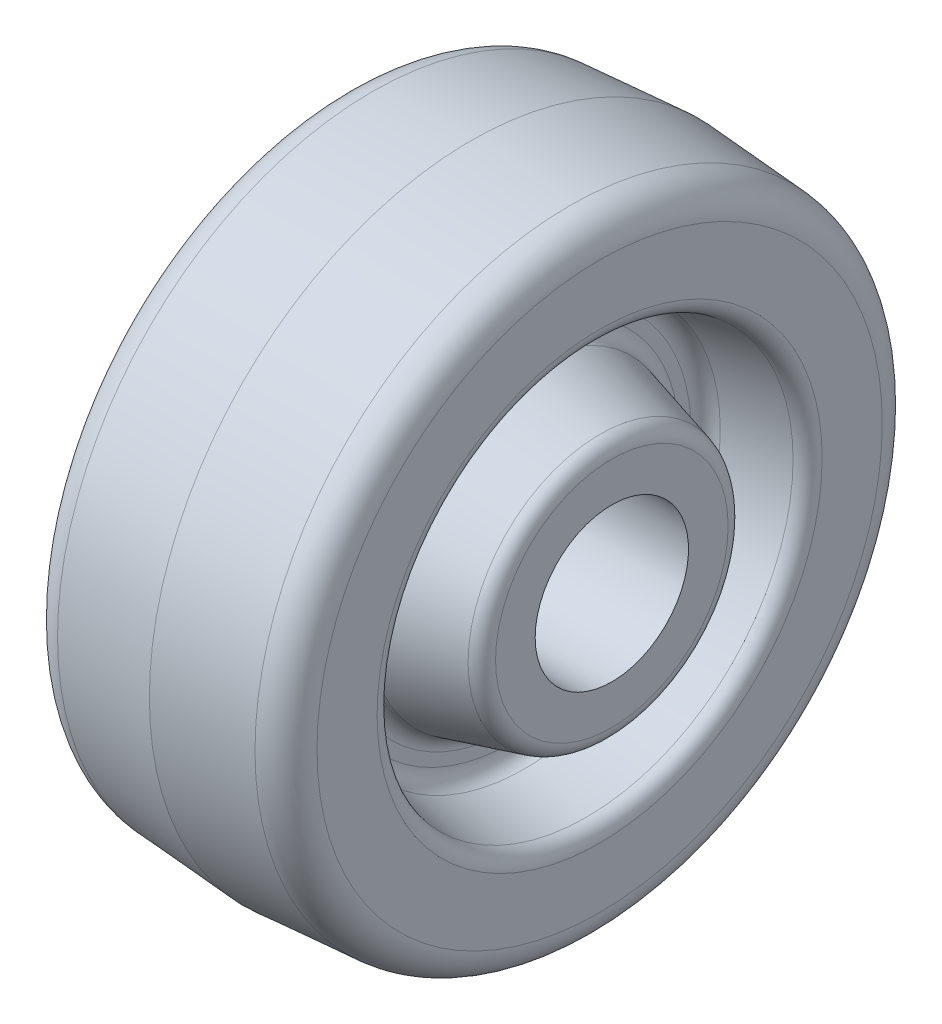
from build123d import *


with BuildPart() as part:
    # Sketch1 → Revolve1 (revolve)
    with BuildSketch(Plane.XY, mode=Mode.PRIVATE) as revolve1_sk:
        with BuildLine():
            Line((0, 63.5), (19.492953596, 62.136919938))
            ThreePointArc((19.492953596, 62.136919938), (23.694096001, 60.133077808), (25.4, 55.802388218))
            Line((25.4, 55.802388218), (25.4, 43.939141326))
            ThreePointArc((25.4, 43.939141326), (24.657191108, 41.898290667), (22.776332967, 40.812376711))
            Line((22.776332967, 40.812376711), (10.561167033, 38.658513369))
            ThreePointArc((10.561167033, 38.658513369), (8.680308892, 37.572599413), (7.9375, 35.531748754))
            Line((7.9375, 35.531748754), (7.9375, 33.161972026))
            ThreePointArc((7.9375, 33.161972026), (8.593598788, 31.229160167), (10.290735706, 30.095161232))
            Line((10.290735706, 30.095161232), (25.459764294, 26.030558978))
            ThreePointArc((25.459764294, 26.030558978), (27.156901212, 24.896560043), (27.813, 22.963748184))
            Line((27.813, 22.963748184), (27.813, 15.1384))
            Line((27.813, 15.1384), (-27.813, 15.1384))
            Line((-27.813, 15.1384), (-27.813, 22.963748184))
            ThreePointArc((-27.813, 22.963748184), (-27.156901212, 24.896560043), (-25.459764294, 26.030558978))
            Line((-25.459764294, 26.030558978), (-10.290735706, 30.095161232))
            ThreePointArc((-10.290735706, 30.095161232), (-8.593598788, 31.229160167), (-7.9375, 33.161972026))
            Line((-7.9375, 33.161972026), (-7.9375, 35.531748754))
            ThreePointArc((-7.9375, 35.531748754), (-8.680308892, 37.572599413), (-10.561167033, 38.658513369))
            Line((-10.561167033, 38.658513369), (-22.776332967, 40.812376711))
            ThreePointArc((-22.776332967, 40.812376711), (-24.657191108, 41.898290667), (-25.4, 43.939141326))
            Line((-25.4, 43.939141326), (-25.4, 55.802388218))
            ThreePointArc((-25.4, 55.802388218), (-23.694096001, 60.133077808), (-19.492953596, 62.136919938))
            Line((-19.492953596, 62.136919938), (0, 63.5))
        make_face()
    revolve(revolve1_sk.sketch.rotate(Axis((-38.862204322, 0, 0), (1, 0, 0)), 90), axis=Axis((-38.862204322, 0, 0), (1, 0, 0)))


solid = part.part
